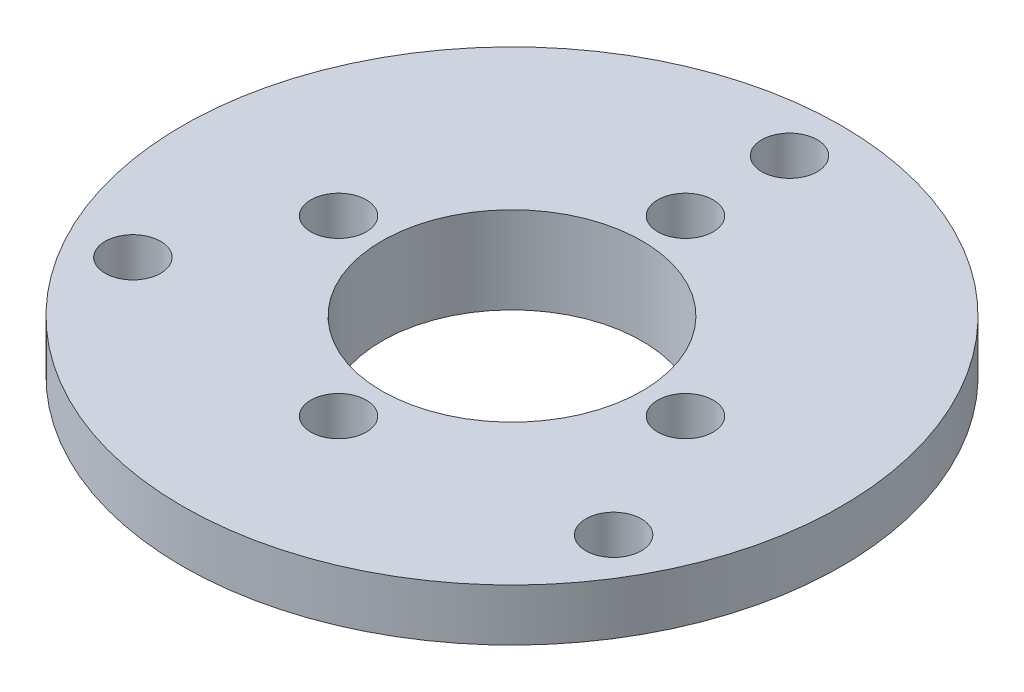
from build123d import *

# Parameters (mm, degrees)
CHANFREIN1_SIZE                 = 0.2
DIAM_TRE_DU_PER_AGE_3_2_3_2_1_D = 3.2


with BuildPart() as part:
    # Esquisse1 → R_volution1 (revolve)
    with BuildSketch(Plane(origin=(0, 0, 0), x_dir=(0, 0, -1), z_dir=(1, 0, 0))):
        Polygon((-7.5, -9.22616979), (-7.5, -14.22616979), (-13, -14.22616979), (-13, -12.22616979), (-19, -12.22616979), (-19, -9.22616979), align=None)
    revolve(axis=Axis((0, 0, 0), (0, -1, 0)))

    # Chanfrein1
    chanfrein1_edges = [part.edges().sort_by_distance(p)[0] for p in [
        (0, -14.22616979, -13),
    ]]
    chamfer(chanfrein1_edges, length=CHANFREIN1_SIZE)

    # Diam_tre du per_age _3.2 _3.2_1 (through all)
    with Locations(Plane(origin=(0, -14.22616979, 0), x_dir=(-1, 0, 0), z_dir=(0, -1, 0))):
        with Locations((0, -10), (10, 0), (0, 10), (-10, 0), (-13.856406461, -8), (0, 16), (13.856406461, -8)):
            Hole(DIAM_TRE_DU_PER_AGE_3_2_3_2_1_D / 2)


solid = part.part
